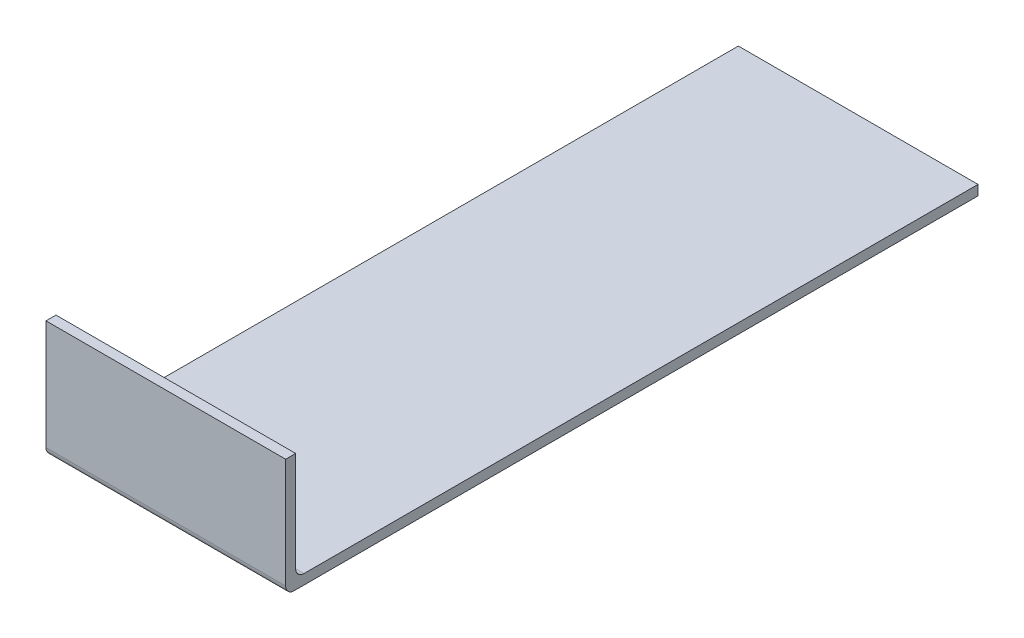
ISO-10303-21;
HEADER;
FILE_DESCRIPTION(('STEP AP214'),'2;1');
FILE_NAME('part.step','',(''),(''),'','','');
FILE_SCHEMA(('AUTOMOTIVE_DESIGN { 1 0 10303 214 1 1 1 1 }'));
ENDSEC;
DATA;
#1=APPLICATION_CONTEXT('core data for automotive mechanical design processes');
#2=APPLICATION_PROTOCOL_DEFINITION('international standard','automotive_design',2000,#1);
#3=PRODUCT_CONTEXT('',#1,'mechanical');
#4=PRODUCT('Part','Part','',(#3));
#5=PRODUCT_RELATED_PRODUCT_CATEGORY('part','',(#4));
#6=PRODUCT_DEFINITION_FORMATION('','',#4);
#7=PRODUCT_DEFINITION_CONTEXT('part definition',#1,'design');
#8=PRODUCT_DEFINITION('design','',#6,#7);
#9=PRODUCT_DEFINITION_SHAPE('','',#8);
#10=(LENGTH_UNIT() NAMED_UNIT(*) SI_UNIT(.MILLI.,.METRE.));
#11=(NAMED_UNIT(*) PLANE_ANGLE_UNIT() SI_UNIT($,.RADIAN.));
#12=(NAMED_UNIT(*) SI_UNIT($,.STERADIAN.) SOLID_ANGLE_UNIT());
#13=UNCERTAINTY_MEASURE_WITH_UNIT(LENGTH_MEASURE(1.E-05),#10,'distance_accuracy_value','');
#14=(GEOMETRIC_REPRESENTATION_CONTEXT(3) GLOBAL_UNCERTAINTY_ASSIGNED_CONTEXT((#13)) GLOBAL_UNIT_ASSIGNED_CONTEXT((#10,
#11,#12)) REPRESENTATION_CONTEXT('',''));
#15=CARTESIAN_POINT('',(0.,0.,0.));
#16=DIRECTION('',(0.,0.,1.));
#17=DIRECTION('',(1.,0.,0.));
#18=AXIS2_PLACEMENT_3D('',#15,#16,#17);
#19=CARTESIAN_POINT('',(0.,6.,416.));
#20=DIRECTION('',(0.,-1.,0.));
#21=DIRECTION('',(1.,0.,0.));
#22=AXIS2_PLACEMENT_3D('',#19,#20,#21);
#23=PLANE('',#22);
#24=DIRECTION('',(0.,0.,-1.));
#25=VECTOR('',#24,1.);
#26=CARTESIAN_POINT('',(0.,6.,416.));
#27=LINE('',#26,#25);
#28=CARTESIAN_POINT('',(0.,6.,405.));
#29=VERTEX_POINT('',#28);
#30=CARTESIAN_POINT('',(0.,6.,0.));
#31=VERTEX_POINT('',#30);
#32=EDGE_CURVE('E133',#29,#31,#27,.T.);
#33=ORIENTED_EDGE('',*,*,#32,.F.);
#34=DIRECTION('',(-1.,0.,0.));
#35=VECTOR('',#34,1.);
#36=CARTESIAN_POINT('',(144.,6.,405.));
#37=LINE('',#36,#35);
#38=CARTESIAN_POINT('',(144.,6.,405.));
#39=VERTEX_POINT('',#38);
#40=EDGE_CURVE('E159',#29,#39,#37,.F.);
#41=ORIENTED_EDGE('',*,*,#40,.T.);
#42=DIRECTION('',(0.,0.,-1.));
#43=VECTOR('',#42,1.);
#44=CARTESIAN_POINT('',(144.,6.,416.));
#45=LINE('',#44,#43);
#46=CARTESIAN_POINT('',(144.,6.,0.));
#47=VERTEX_POINT('',#46);
#48=EDGE_CURVE('E153',#39,#47,#45,.T.);
#49=ORIENTED_EDGE('',*,*,#48,.T.);
#50=DIRECTION('',(-1.,0.,0.));
#51=VECTOR('',#50,1.);
#52=CARTESIAN_POINT('',(0.,6.,0.));
#53=LINE('',#52,#51);
#54=EDGE_CURVE('E113',#47,#31,#53,.T.);
#55=ORIENTED_EDGE('',*,*,#54,.T.);
#56=EDGE_LOOP('',(#33,#41,#49,#55));
#57=FACE_BOUND('',#56,.T.);
#58=ADVANCED_FACE('F39',(#57),#23,.F.);
#59=CARTESIAN_POINT('',(0.,0.,416.));
#60=DIRECTION('',(1.,0.,0.));
#61=DIRECTION('',(0.,0.,-1.));
#62=AXIS2_PLACEMENT_3D('',#59,#60,#61);
#63=PLANE('',#62);
#64=DIRECTION('',(0.,0.,-1.));
#65=VECTOR('',#64,1.);
#66=CARTESIAN_POINT('',(0.,0.,416.));
#67=LINE('',#66,#65);
#68=CARTESIAN_POINT('',(0.,0.,411.));
#69=VERTEX_POINT('',#68);
#70=CARTESIAN_POINT('',(0.,0.,0.));
#71=VERTEX_POINT('',#70);
#72=EDGE_CURVE('E177',#69,#71,#67,.T.);
#73=ORIENTED_EDGE('',*,*,#72,.F.);
#74=CARTESIAN_POINT('',(0.,5.,411.));
#75=DIRECTION('',(1.,0.,0.));
#76=DIRECTION('',(0.,0.,-1.));
#77=AXIS2_PLACEMENT_3D('',#74,#75,#76);
#78=CIRCLE('',#77,5.);
#79=CARTESIAN_POINT('',(0.,5.,416.));
#80=VERTEX_POINT('',#79);
#81=EDGE_CURVE('E108',#69,#80,#78,.F.);
#82=ORIENTED_EDGE('',*,*,#81,.T.);
#83=DIRECTION('',(0.,-1.,0.));
#84=VECTOR('',#83,1.);
#85=CARTESIAN_POINT('',(0.,0.,416.));
#86=LINE('',#85,#84);
#87=CARTESIAN_POINT('',(0.,71.,416.));
#88=VERTEX_POINT('',#87);
#89=EDGE_CURVE('E101',#88,#80,#86,.T.);
#90=ORIENTED_EDGE('',*,*,#89,.F.);
#91=DIRECTION('',(0.,0.,1.));
#92=VECTOR('',#91,1.);
#93=CARTESIAN_POINT('',(0.,71.,416.));
#94=LINE('',#93,#92);
#95=CARTESIAN_POINT('',(0.,71.,410.));
#96=VERTEX_POINT('',#95);
#97=EDGE_CURVE('E106',#96,#88,#94,.T.);
#98=ORIENTED_EDGE('',*,*,#97,.F.);
#99=DIRECTION('',(0.,-1.,0.));
#100=VECTOR('',#99,1.);
#101=CARTESIAN_POINT('',(0.,71.,410.));
#102=LINE('',#101,#100);
#103=CARTESIAN_POINT('',(0.,11.,410.));
#104=VERTEX_POINT('',#103);
#105=EDGE_CURVE('E130',#96,#104,#102,.T.);
#106=ORIENTED_EDGE('',*,*,#105,.T.);
#107=CARTESIAN_POINT('',(0.,11.,405.));
#108=DIRECTION('',(1.,0.,0.));
#109=DIRECTION('',(0.,0.,-1.));
#110=AXIS2_PLACEMENT_3D('',#107,#108,#109);
#111=CIRCLE('',#110,5.);
#112=EDGE_CURVE('E47',#104,#29,#111,.T.);
#113=ORIENTED_EDGE('',*,*,#112,.T.);
#114=ORIENTED_EDGE('',*,*,#32,.T.);
#115=DIRECTION('',(0.,-1.,0.));
#116=VECTOR('',#115,1.);
#117=CARTESIAN_POINT('',(0.,0.,0.));
#118=LINE('',#117,#116);
#119=EDGE_CURVE('E134',#31,#71,#118,.T.);
#120=ORIENTED_EDGE('',*,*,#119,.T.);
#121=EDGE_LOOP('',(#73,#82,#90,#98,#106,#113,#114,#120));
#122=FACE_BOUND('',#121,.T.);
#123=ADVANCED_FACE('F104',(#122),#63,.F.);
#124=CARTESIAN_POINT('',(0.,0.,416.));
#125=DIRECTION('',(0.,1.,0.));
#126=DIRECTION('',(0.,0.,1.));
#127=AXIS2_PLACEMENT_3D('',#124,#125,#126);
#128=PLANE('',#127);
#129=DIRECTION('',(0.,0.,-1.));
#130=VECTOR('',#129,1.);
#131=CARTESIAN_POINT('',(144.,0.,416.));
#132=LINE('',#131,#130);
#133=CARTESIAN_POINT('',(144.,0.,411.));
#134=VERTEX_POINT('',#133);
#135=CARTESIAN_POINT('',(144.,0.,0.));
#136=VERTEX_POINT('',#135);
#137=EDGE_CURVE('E169',#134,#136,#132,.T.);
#138=ORIENTED_EDGE('',*,*,#137,.F.);
#139=DIRECTION('',(1.,0.,0.));
#140=VECTOR('',#139,1.);
#141=CARTESIAN_POINT('',(0.,0.,411.));
#142=LINE('',#141,#140);
#143=EDGE_CURVE('E154',#134,#69,#142,.F.);
#144=ORIENTED_EDGE('',*,*,#143,.T.);
#145=ORIENTED_EDGE('',*,*,#72,.T.);
#146=DIRECTION('',(1.,0.,0.));
#147=VECTOR('',#146,1.);
#148=CARTESIAN_POINT('',(0.,0.,0.));
#149=LINE('',#148,#147);
#150=EDGE_CURVE('E137',#71,#136,#149,.T.);
#151=ORIENTED_EDGE('',*,*,#150,.T.);
#152=EDGE_LOOP('',(#138,#144,#145,#151));
#153=FACE_BOUND('',#152,.T.);
#154=ADVANCED_FACE('F187',(#153),#128,.F.);
#155=CARTESIAN_POINT('',(144.,0.,416.));
#156=DIRECTION('',(-1.,0.,0.));
#157=DIRECTION('',(0.,0.,1.));
#158=AXIS2_PLACEMENT_3D('',#155,#156,#157);
#159=PLANE('',#158);
#160=DIRECTION('',(0.,1.,0.));
#161=VECTOR('',#160,1.);
#162=CARTESIAN_POINT('',(144.,0.,416.));
#163=LINE('',#162,#161);
#164=CARTESIAN_POINT('',(144.,5.,416.));
#165=VERTEX_POINT('',#164);
#166=CARTESIAN_POINT('',(144.,71.,416.));
#167=VERTEX_POINT('',#166);
#168=EDGE_CURVE('E112',#165,#167,#163,.T.);
#169=ORIENTED_EDGE('',*,*,#168,.F.);
#170=CARTESIAN_POINT('',(144.,5.,411.));
#171=DIRECTION('',(-1.,0.,0.));
#172=DIRECTION('',(0.,0.,1.));
#173=AXIS2_PLACEMENT_3D('',#170,#171,#172);
#174=CIRCLE('',#173,5.);
#175=EDGE_CURVE('E183',#165,#134,#174,.F.);
#176=ORIENTED_EDGE('',*,*,#175,.T.);
#177=ORIENTED_EDGE('',*,*,#137,.T.);
#178=DIRECTION('',(0.,1.,0.));
#179=VECTOR('',#178,1.);
#180=CARTESIAN_POINT('',(144.,0.,0.));
#181=LINE('',#180,#179);
#182=EDGE_CURVE('E141',#136,#47,#181,.T.);
#183=ORIENTED_EDGE('',*,*,#182,.T.);
#184=ORIENTED_EDGE('',*,*,#48,.F.);
#185=CARTESIAN_POINT('',(144.,11.,405.));
#186=DIRECTION('',(-1.,0.,0.));
#187=DIRECTION('',(0.,0.,1.));
#188=AXIS2_PLACEMENT_3D('',#185,#186,#187);
#189=CIRCLE('',#188,5.);
#190=CARTESIAN_POINT('',(144.,11.,410.));
#191=VERTEX_POINT('',#190);
#192=EDGE_CURVE('E11',#39,#191,#189,.T.);
#193=ORIENTED_EDGE('',*,*,#192,.T.);
#194=DIRECTION('',(0.,-1.,0.));
#195=VECTOR('',#194,1.);
#196=CARTESIAN_POINT('',(144.,71.,410.));
#197=LINE('',#196,#195);
#198=CARTESIAN_POINT('',(144.,71.,410.));
#199=VERTEX_POINT('',#198);
#200=EDGE_CURVE('E138',#199,#191,#197,.T.);
#201=ORIENTED_EDGE('',*,*,#200,.F.);
#202=DIRECTION('',(0.,0.,-1.));
#203=VECTOR('',#202,1.);
#204=CARTESIAN_POINT('',(144.,71.,416.));
#205=LINE('',#204,#203);
#206=EDGE_CURVE('E121',#167,#199,#205,.T.);
#207=ORIENTED_EDGE('',*,*,#206,.F.);
#208=EDGE_LOOP('',(#169,#176,#177,#183,#184,#193,#201,#207));
#209=FACE_BOUND('',#208,.T.);
#210=ADVANCED_FACE('F164',(#209),#159,.F.);
#211=CARTESIAN_POINT('',(0.,6.,416.));
#212=DIRECTION('',(0.,0.,-1.));
#213=DIRECTION('',(-1.,0.,0.));
#214=AXIS2_PLACEMENT_3D('',#211,#212,#213);
#215=PLANE('',#214);
#216=ORIENTED_EDGE('',*,*,#89,.T.);
#217=DIRECTION('',(1.,0.,0.));
#218=VECTOR('',#217,1.);
#219=CARTESIAN_POINT('',(0.,5.,416.));
#220=LINE('',#219,#218);
#221=EDGE_CURVE('E182',#80,#165,#220,.T.);
#222=ORIENTED_EDGE('',*,*,#221,.T.);
#223=ORIENTED_EDGE('',*,*,#168,.T.);
#224=DIRECTION('',(1.,0.,0.));
#225=VECTOR('',#224,1.);
#226=CARTESIAN_POINT('',(0.,71.,416.));
#227=LINE('',#226,#225);
#228=EDGE_CURVE('E116',#88,#167,#227,.T.);
#229=ORIENTED_EDGE('',*,*,#228,.F.);
#230=EDGE_LOOP('',(#216,#222,#223,#229));
#231=FACE_BOUND('',#230,.T.);
#232=ADVANCED_FACE('F117',(#231),#215,.F.);
#233=CARTESIAN_POINT('',(0.,6.,0.));
#234=DIRECTION('',(0.,0.,-1.));
#235=DIRECTION('',(-1.,0.,0.));
#236=AXIS2_PLACEMENT_3D('',#233,#234,#235);
#237=PLANE('',#236);
#238=ORIENTED_EDGE('',*,*,#119,.F.);
#239=ORIENTED_EDGE('',*,*,#54,.F.);
#240=ORIENTED_EDGE('',*,*,#182,.F.);
#241=ORIENTED_EDGE('',*,*,#150,.F.);
#242=EDGE_LOOP('',(#238,#239,#240,#241));
#243=FACE_BOUND('',#242,.T.);
#244=ADVANCED_FACE('F207',(#243),#237,.T.);
#245=CARTESIAN_POINT('',(0.,71.,410.));
#246=DIRECTION('',(0.,0.,1.));
#247=DIRECTION('',(1.,0.,0.));
#248=AXIS2_PLACEMENT_3D('',#245,#246,#247);
#249=PLANE('',#248);
#250=ORIENTED_EDGE('',*,*,#200,.T.);
#251=DIRECTION('',(-1.,0.,0.));
#252=VECTOR('',#251,1.);
#253=CARTESIAN_POINT('',(0.,11.,410.));
#254=LINE('',#253,#252);
#255=EDGE_CURVE('E157',#191,#104,#254,.T.);
#256=ORIENTED_EDGE('',*,*,#255,.T.);
#257=ORIENTED_EDGE('',*,*,#105,.F.);
#258=DIRECTION('',(-1.,0.,0.));
#259=VECTOR('',#258,1.);
#260=CARTESIAN_POINT('',(0.,71.,410.));
#261=LINE('',#260,#259);
#262=EDGE_CURVE('E125',#199,#96,#261,.T.);
#263=ORIENTED_EDGE('',*,*,#262,.F.);
#264=EDGE_LOOP('',(#250,#256,#257,#263));
#265=FACE_BOUND('',#264,.T.);
#266=ADVANCED_FACE('F172',(#265),#249,.F.);
#267=CARTESIAN_POINT('',(0.,71.,410.));
#268=DIRECTION('',(0.,-1.,0.));
#269=DIRECTION('',(1.,0.,0.));
#270=AXIS2_PLACEMENT_3D('',#267,#268,#269);
#271=PLANE('',#270);
#272=ORIENTED_EDGE('',*,*,#97,.T.);
#273=ORIENTED_EDGE('',*,*,#228,.T.);
#274=ORIENTED_EDGE('',*,*,#206,.T.);
#275=ORIENTED_EDGE('',*,*,#262,.T.);
#276=EDGE_LOOP('',(#272,#273,#274,#275));
#277=FACE_BOUND('',#276,.T.);
#278=ADVANCED_FACE('F123',(#277),#271,.F.);
#279=CARTESIAN_POINT('',(0.,5.,411.));
#280=DIRECTION('',(1.,0.,0.));
#281=DIRECTION('',(0.,0.,-1.));
#282=AXIS2_PLACEMENT_3D('',#279,#280,#281);
#283=CYLINDRICAL_SURFACE('',#282,5.);
#284=ORIENTED_EDGE('',*,*,#81,.F.);
#285=ORIENTED_EDGE('',*,*,#143,.F.);
#286=ORIENTED_EDGE('',*,*,#175,.F.);
#287=ORIENTED_EDGE('',*,*,#221,.F.);
#288=EDGE_LOOP('',(#284,#285,#286,#287));
#289=FACE_BOUND('',#288,.T.);
#290=ADVANCED_FACE('F191',(#289),#283,.T.);
#291=CARTESIAN_POINT('',(0.,11.,405.));
#292=DIRECTION('',(1.,0.,0.));
#293=DIRECTION('',(0.,0.,-1.));
#294=AXIS2_PLACEMENT_3D('',#291,#292,#293);
#295=CYLINDRICAL_SURFACE('',#294,5.);
#296=ORIENTED_EDGE('',*,*,#192,.F.);
#297=ORIENTED_EDGE('',*,*,#40,.F.);
#298=ORIENTED_EDGE('',*,*,#112,.F.);
#299=ORIENTED_EDGE('',*,*,#255,.F.);
#300=EDGE_LOOP('',(#296,#297,#298,#299));
#301=FACE_BOUND('',#300,.T.);
#302=ADVANCED_FACE('F41',(#301),#295,.F.);
#303=CLOSED_SHELL('',(#58,#123,#154,#210,#232,#244,#266,#278,#290,#302));
#304=MANIFOLD_SOLID_BREP('B2',#303);
#305=ADVANCED_BREP_SHAPE_REPRESENTATION('',(#18,#304),#14);
#306=SHAPE_DEFINITION_REPRESENTATION(#9,#305);
ENDSEC;
END-ISO-10303-21;
